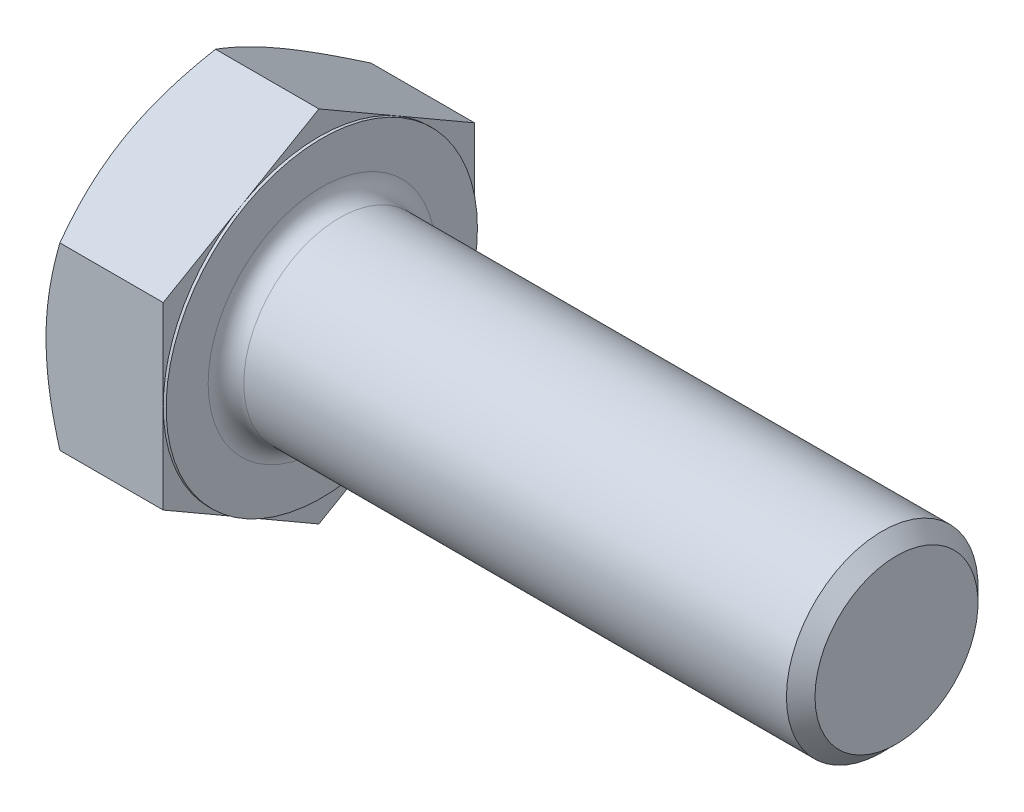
ISO-10303-21;
HEADER;
FILE_DESCRIPTION(('STEP AP214'),'2;1');
FILE_NAME('part.step','',(''),(''),'','','');
FILE_SCHEMA(('AUTOMOTIVE_DESIGN { 1 0 10303 214 1 1 1 1 }'));
ENDSEC;
DATA;
#1=APPLICATION_CONTEXT('core data for automotive mechanical design processes');
#2=APPLICATION_PROTOCOL_DEFINITION('international standard','automotive_design',2000,#1);
#3=PRODUCT_CONTEXT('',#1,'mechanical');
#4=PRODUCT('Part','Part','',(#3));
#5=PRODUCT_RELATED_PRODUCT_CATEGORY('part','',(#4));
#6=PRODUCT_DEFINITION_FORMATION('','',#4);
#7=PRODUCT_DEFINITION_CONTEXT('part definition',#1,'design');
#8=PRODUCT_DEFINITION('design','',#6,#7);
#9=PRODUCT_DEFINITION_SHAPE('','',#8);
#10=(LENGTH_UNIT() NAMED_UNIT(*) SI_UNIT(.MILLI.,.METRE.));
#11=(NAMED_UNIT(*) PLANE_ANGLE_UNIT() SI_UNIT($,.RADIAN.));
#12=(NAMED_UNIT(*) SI_UNIT($,.STERADIAN.) SOLID_ANGLE_UNIT());
#13=UNCERTAINTY_MEASURE_WITH_UNIT(LENGTH_MEASURE(1.E-05),#10,'distance_accuracy_value','');
#14=(GEOMETRIC_REPRESENTATION_CONTEXT(3) GLOBAL_UNCERTAINTY_ASSIGNED_CONTEXT((#13)) GLOBAL_UNIT_ASSIGNED_CONTEXT((#10,
#11,#12)) REPRESENTATION_CONTEXT('',''));
#15=CARTESIAN_POINT('',(0.,0.,0.));
#16=DIRECTION('',(0.,0.,1.));
#17=DIRECTION('',(1.,0.,0.));
#18=AXIS2_PLACEMENT_3D('',#15,#16,#17);
#19=CARTESIAN_POINT('',(15.9258,23.8301323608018,0.));
#20=DIRECTION('',(1.,0.,0.));
#21=DIRECTION('',(0.,0.,-1.));
#22=AXIS2_PLACEMENT_3D('',#19,#20,#21);
#23=PLANE('',#22);
#24=CARTESIAN_POINT('',(15.9258,0.,0.));
#25=DIRECTION('',(1.,0.,0.));
#26=DIRECTION('',(0.,0.,-1.));
#27=AXIS2_PLACEMENT_3D('',#24,#25,#26);
#28=CIRCLE('',#27,15.0622);
#29=CARTESIAN_POINT('',(15.9258,0.,-15.0622));
#30=VERTEX_POINT('',#29);
#31=EDGE_CURVE('E47',#30,#30,#28,.F.);
#32=ORIENTED_EDGE('',*,*,#31,.T.);
#33=EDGE_LOOP('',(#32));
#34=FACE_BOUND('',#33,.T.);
#35=CARTESIAN_POINT('',(15.9258,0.,0.));
#36=DIRECTION('',(1.,0.,0.));
#37=DIRECTION('',(0.,0.,-1.));
#38=AXIS2_PLACEMENT_3D('',#35,#36,#37);
#39=CIRCLE('',#38,20.6375);
#40=CARTESIAN_POINT('',(15.9258,0.,-20.6375));
#41=VERTEX_POINT('',#40);
#42=EDGE_CURVE('E305',#41,#41,#39,.T.);
#43=ORIENTED_EDGE('',*,*,#42,.T.);
#44=EDGE_LOOP('',(#43));
#45=FACE_BOUND('',#44,.T.);
#46=ADVANCED_FACE('F39',(#34,#45),#23,.T.);
#47=CARTESIAN_POINT('',(0.,0.,0.));
#48=DIRECTION('',(-1.,0.,0.));
#49=DIRECTION('',(0.,0.,1.));
#50=AXIS2_PLACEMENT_3D('',#47,#48,#49);
#51=CYLINDRICAL_SURFACE('',#50,12.7);
#52=CARTESIAN_POINT('',(18.288,0.,0.));
#53=DIRECTION('',(1.,0.,0.));
#54=DIRECTION('',(0.,0.,-1.));
#55=AXIS2_PLACEMENT_3D('',#52,#53,#54);
#56=CIRCLE('',#55,12.7);
#57=CARTESIAN_POINT('',(18.288,0.,-12.7));
#58=VERTEX_POINT('',#57);
#59=EDGE_CURVE('E11',#58,#58,#56,.T.);
#60=ORIENTED_EDGE('',*,*,#59,.T.);
#61=EDGE_LOOP('',(#60));
#62=FACE_BOUND('',#61,.T.);
#63=CARTESIAN_POINT('',(90.2335,0.,0.));
#64=DIRECTION('',(-1.,0.,0.));
#65=DIRECTION('',(0.,0.,1.));
#66=AXIS2_PLACEMENT_3D('',#63,#64,#65);
#67=CIRCLE('',#66,12.7);
#68=CARTESIAN_POINT('',(90.2335,0.,12.7));
#69=VERTEX_POINT('',#68);
#70=EDGE_CURVE('E284',#69,#69,#67,.T.);
#71=ORIENTED_EDGE('',*,*,#70,.T.);
#72=EDGE_LOOP('',(#71));
#73=FACE_BOUND('',#72,.T.);
#74=ADVANCED_FACE('F257',(#62,#73),#51,.T.);
#75=CARTESIAN_POINT('',(92.1258,0.,0.));
#76=DIRECTION('',(-1.,0.,0.));
#77=DIRECTION('',(0.,0.,1.));
#78=AXIS2_PLACEMENT_3D('',#75,#76,#77);
#79=CONICAL_SURFACE('',#78,10.8077,0.785398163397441);
#80=ORIENTED_EDGE('',*,*,#70,.F.);
#81=EDGE_LOOP('',(#80));
#82=FACE_BOUND('',#81,.T.);
#83=CARTESIAN_POINT('',(92.1258,0.,0.));
#84=DIRECTION('',(-1.,0.,0.));
#85=DIRECTION('',(0.,0.,1.));
#86=AXIS2_PLACEMENT_3D('',#83,#84,#85);
#87=CIRCLE('',#86,10.8077);
#88=CARTESIAN_POINT('',(92.1258,0.,10.8077));
#89=VERTEX_POINT('',#88);
#90=EDGE_CURVE('E282',#89,#89,#87,.T.);
#91=ORIENTED_EDGE('',*,*,#90,.T.);
#92=EDGE_LOOP('',(#91));
#93=FACE_BOUND('',#92,.T.);
#94=ADVANCED_FACE('F262',(#82,#93),#79,.T.);
#95=CARTESIAN_POINT('',(92.1258,0.,0.));
#96=DIRECTION('',(-1.,0.,0.));
#97=DIRECTION('',(0.,0.,1.));
#98=AXIS2_PLACEMENT_3D('',#95,#96,#97);
#99=PLANE('',#98);
#100=ORIENTED_EDGE('',*,*,#90,.F.);
#101=EDGE_LOOP('',(#100));
#102=FACE_BOUND('',#101,.T.);
#103=ADVANCED_FACE('F269',(#102),#99,.F.);
#104=CARTESIAN_POINT('',(15.5448,20.6375,0.));
#105=DIRECTION('',(1.,0.,0.));
#106=DIRECTION('',(0.,0.,-1.));
#107=AXIS2_PLACEMENT_3D('',#104,#105,#106);
#108=PLANE('',#107);
#109=DIRECTION('',(0.,0.500000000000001,0.866025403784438));
#110=VECTOR('',#109,1.);
#111=CARTESIAN_POINT('',(15.5448,11.9150661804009,-20.6375));
#112=LINE('',#111,#110);
#113=CARTESIAN_POINT('',(15.5448,11.9150661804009,-20.6375));
#114=VERTEX_POINT('',#113);
#115=CARTESIAN_POINT('',(15.5448,17.8725992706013,-10.31875));
#116=VERTEX_POINT('',#115);
#117=EDGE_CURVE('E171',#114,#116,#112,.T.);
#118=ORIENTED_EDGE('',*,*,#117,.T.);
#119=CARTESIAN_POINT('',(15.5448,0.,0.));
#120=DIRECTION('',(-1.,0.,0.));
#121=DIRECTION('',(0.,0.,1.));
#122=AXIS2_PLACEMENT_3D('',#119,#120,#121);
#123=CIRCLE('',#122,20.6375);
#124=CARTESIAN_POINT('',(15.5448,0.,-20.6375));
#125=VERTEX_POINT('',#124);
#126=EDGE_CURVE('E54',#116,#125,#123,.T.);
#127=ORIENTED_EDGE('',*,*,#126,.T.);
#128=DIRECTION('',(0.,1.,0.));
#129=VECTOR('',#128,1.);
#130=CARTESIAN_POINT('',(15.5448,11.9150661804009,-20.6375));
#131=LINE('',#130,#129);
#132=EDGE_CURVE('E308',#125,#114,#131,.T.);
#133=ORIENTED_EDGE('',*,*,#132,.T.);
#134=EDGE_LOOP('',(#118,#127,#133));
#135=FACE_BOUND('',#134,.T.);
#136=ADVANCED_FACE('F272',(#135),#108,.T.);
#137=CARTESIAN_POINT('',(15.5448,23.8301323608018,0.));
#138=VERTEX_POINT('',#137);
#139=EDGE_CURVE('E169',#116,#138,#112,.T.);
#140=ORIENTED_EDGE('',*,*,#139,.T.);
#141=DIRECTION('',(0.,-0.500000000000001,0.866025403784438));
#142=VECTOR('',#141,1.);
#143=CARTESIAN_POINT('',(15.5448,23.8301323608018,0.));
#144=LINE('',#143,#142);
#145=CARTESIAN_POINT('',(15.5448,17.8725992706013,10.31875));
#146=VERTEX_POINT('',#145);
#147=EDGE_CURVE('E168',#138,#146,#144,.T.);
#148=ORIENTED_EDGE('',*,*,#147,.T.);
#149=EDGE_CURVE('E157',#146,#116,#123,.T.);
#150=ORIENTED_EDGE('',*,*,#149,.T.);
#151=EDGE_LOOP('',(#140,#148,#150));
#152=FACE_BOUND('',#151,.T.);
#153=ADVANCED_FACE('F278',(#152),#108,.T.);
#154=CARTESIAN_POINT('',(15.5448,11.9150661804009,20.6375));
#155=VERTEX_POINT('',#154);
#156=EDGE_CURVE('E136',#146,#155,#144,.T.);
#157=ORIENTED_EDGE('',*,*,#156,.T.);
#158=DIRECTION('',(0.,-1.,0.));
#159=VECTOR('',#158,1.);
#160=CARTESIAN_POINT('',(15.5448,11.9150661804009,20.6375));
#161=LINE('',#160,#159);
#162=CARTESIAN_POINT('',(15.5448,0.,20.6375));
#163=VERTEX_POINT('',#162);
#164=EDGE_CURVE('E130',#155,#163,#161,.T.);
#165=ORIENTED_EDGE('',*,*,#164,.T.);
#166=EDGE_CURVE('E134',#163,#146,#123,.T.);
#167=ORIENTED_EDGE('',*,*,#166,.T.);
#168=EDGE_LOOP('',(#157,#165,#167));
#169=FACE_BOUND('',#168,.T.);
#170=ADVANCED_FACE('F132',(#169),#108,.T.);
#171=CARTESIAN_POINT('',(15.5448,-11.9150661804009,20.6375));
#172=VERTEX_POINT('',#171);
#173=EDGE_CURVE('E140',#163,#172,#161,.T.);
#174=ORIENTED_EDGE('',*,*,#173,.T.);
#175=DIRECTION('',(0.,-0.500000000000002,-0.866025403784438));
#176=VECTOR('',#175,1.);
#177=CARTESIAN_POINT('',(15.5448,-23.8301323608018,0.));
#178=LINE('',#177,#176);
#179=CARTESIAN_POINT('',(15.5448,-17.8725992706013,10.31875));
#180=VERTEX_POINT('',#179);
#181=EDGE_CURVE('E147',#172,#180,#178,.T.);
#182=ORIENTED_EDGE('',*,*,#181,.T.);
#183=EDGE_CURVE('E144',#180,#163,#123,.T.);
#184=ORIENTED_EDGE('',*,*,#183,.T.);
#185=EDGE_LOOP('',(#174,#182,#184));
#186=FACE_BOUND('',#185,.T.);
#187=ADVANCED_FACE('F145',(#186),#108,.T.);
#188=CARTESIAN_POINT('',(15.5448,-23.8301323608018,0.));
#189=VERTEX_POINT('',#188);
#190=EDGE_CURVE('E163',#180,#189,#178,.T.);
#191=ORIENTED_EDGE('',*,*,#190,.T.);
#192=DIRECTION('',(0.,0.5,-0.866025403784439));
#193=VECTOR('',#192,1.);
#194=CARTESIAN_POINT('',(15.5448,-11.9150661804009,-20.6375));
#195=LINE('',#194,#193);
#196=CARTESIAN_POINT('',(15.5448,-17.8725992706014,-10.31875));
#197=VERTEX_POINT('',#196);
#198=EDGE_CURVE('E346',#189,#197,#195,.T.);
#199=ORIENTED_EDGE('',*,*,#198,.T.);
#200=EDGE_CURVE('E151',#197,#180,#123,.T.);
#201=ORIENTED_EDGE('',*,*,#200,.T.);
#202=EDGE_LOOP('',(#191,#199,#201));
#203=FACE_BOUND('',#202,.T.);
#204=ADVANCED_FACE('F347',(#203),#108,.T.);
#205=CARTESIAN_POINT('',(15.5448,-11.9150661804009,-20.6375));
#206=VERTEX_POINT('',#205);
#207=EDGE_CURVE('E158',#197,#206,#195,.T.);
#208=ORIENTED_EDGE('',*,*,#207,.T.);
#209=EDGE_CURVE('E309',#206,#125,#131,.T.);
#210=ORIENTED_EDGE('',*,*,#209,.T.);
#211=EDGE_CURVE('E316',#125,#197,#123,.T.);
#212=ORIENTED_EDGE('',*,*,#211,.T.);
#213=EDGE_LOOP('',(#208,#210,#212));
#214=FACE_BOUND('',#213,.T.);
#215=ADVANCED_FACE('F279',(#214),#108,.T.);
#216=CARTESIAN_POINT('',(0.,0.,0.));
#217=DIRECTION('',(-1.,0.,0.));
#218=DIRECTION('',(0.,0.,1.));
#219=AXIS2_PLACEMENT_3D('',#216,#217,#218);
#220=CYLINDRICAL_SURFACE('',#219,20.6375);
#221=ORIENTED_EDGE('',*,*,#126,.F.);
#222=ORIENTED_EDGE('',*,*,#149,.F.);
#223=ORIENTED_EDGE('',*,*,#166,.F.);
#224=ORIENTED_EDGE('',*,*,#183,.F.);
#225=ORIENTED_EDGE('',*,*,#200,.F.);
#226=ORIENTED_EDGE('',*,*,#211,.F.);
#227=EDGE_LOOP('',(#221,#222,#223,#224,#225,#226));
#228=FACE_BOUND('',#227,.T.);
#229=ORIENTED_EDGE('',*,*,#42,.F.);
#230=EDGE_LOOP('',(#229));
#231=FACE_BOUND('',#230,.T.);
#232=ADVANCED_FACE('F154',(#228,#231),#220,.T.);
#233=CARTESIAN_POINT('',(0.,23.8301323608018,0.));
#234=DIRECTION('',(1.,0.,0.));
#235=DIRECTION('',(0.,0.,-1.));
#236=AXIS2_PLACEMENT_3D('',#233,#234,#235);
#237=PLANE('',#236);
#238=CARTESIAN_POINT('',(0.,0.,0.));
#239=DIRECTION('',(1.,0.,0.));
#240=DIRECTION('',(0.,0.,-1.));
#241=AXIS2_PLACEMENT_3D('',#238,#239,#240);
#242=CIRCLE('',#241,20.6375);
#243=CARTESIAN_POINT('',(0.,0.,-20.6375));
#244=VERTEX_POINT('',#243);
#245=CARTESIAN_POINT('',(0.,17.8725992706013,-10.31875));
#246=VERTEX_POINT('',#245);
#247=EDGE_CURVE('E304',#244,#246,#242,.T.);
#248=ORIENTED_EDGE('',*,*,#247,.F.);
#249=CARTESIAN_POINT('',(0.,-17.8725992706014,-10.31875));
#250=VERTEX_POINT('',#249);
#251=EDGE_CURVE('E300',#250,#244,#242,.T.);
#252=ORIENTED_EDGE('',*,*,#251,.F.);
#253=CARTESIAN_POINT('',(0.,-17.8725992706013,10.31875));
#254=VERTEX_POINT('',#253);
#255=EDGE_CURVE('E303',#254,#250,#242,.T.);
#256=ORIENTED_EDGE('',*,*,#255,.F.);
#257=CARTESIAN_POINT('',(0.,0.,20.6375));
#258=VERTEX_POINT('',#257);
#259=EDGE_CURVE('E339',#258,#254,#242,.T.);
#260=ORIENTED_EDGE('',*,*,#259,.F.);
#261=CARTESIAN_POINT('',(0.,0.,0.));
#262=DIRECTION('',(-1.,0.,0.));
#263=DIRECTION('',(0.,0.,1.));
#264=AXIS2_PLACEMENT_3D('',#261,#262,#263);
#265=CIRCLE('',#264,20.6375);
#266=CARTESIAN_POINT('',(0.,17.8725992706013,10.31875));
#267=VERTEX_POINT('',#266);
#268=EDGE_CURVE('E172',#258,#267,#265,.T.);
#269=ORIENTED_EDGE('',*,*,#268,.T.);
#270=EDGE_CURVE('E362',#246,#267,#242,.T.);
#271=ORIENTED_EDGE('',*,*,#270,.F.);
#272=EDGE_LOOP('',(#248,#252,#256,#260,#269,#271));
#273=FACE_BOUND('',#272,.T.);
#274=ADVANCED_FACE('F203',(#273),#237,.F.);
#275=CARTESIAN_POINT('',(0.,0.,0.));
#276=DIRECTION('',(1.,0.,0.));
#277=DIRECTION('',(0.,0.,-1.));
#278=AXIS2_PLACEMENT_3D('',#275,#276,#277);
#279=CONICAL_SURFACE('',#278,20.6375,1.0471975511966);
#280=CARTESIAN_POINT('',(1.84333382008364,11.914950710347,20.6377));
#281=CARTESIAN_POINT('',(1.69214337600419,12.1768388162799,20.1840964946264));
#282=CARTESIAN_POINT('',(1.54781374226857,12.4397484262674,19.7287236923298));
#283=CARTESIAN_POINT('',(1.27478315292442,12.9676758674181,18.814326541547));
#284=CARTESIAN_POINT('',(1.14608733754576,13.2326943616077,18.3553010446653));
#285=CARTESIAN_POINT('',(0.906054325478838,13.7653517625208,17.4327113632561));
#286=CARTESIAN_POINT('',(0.794758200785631,14.0329953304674,16.9691391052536));
#287=CARTESIAN_POINT('',(0.591914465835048,14.5701421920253,16.0387734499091));
#288=CARTESIAN_POINT('',(0.50036572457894,14.8396453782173,15.571980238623));
#289=CARTESIAN_POINT('',(0.340910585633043,15.3736059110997,14.6471334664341));
#290=CARTESIAN_POINT('',(0.272476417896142,15.6380236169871,14.1891485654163));
#291=CARTESIAN_POINT('',(0.157727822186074,16.1680706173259,13.27108023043));
#292=CARTESIAN_POINT('',(0.111413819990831,16.4336999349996,12.8109967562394));
#293=CARTESIAN_POINT('',(0.0420749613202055,16.9654047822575,11.890056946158));
#294=CARTESIAN_POINT('',(0.0190224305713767,17.2314794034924,11.4292021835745));
#295=CARTESIAN_POINT('',(-0.00329774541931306,17.7638741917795,10.5070673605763));
#296=CARTESIAN_POINT('',(-0.00256612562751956,18.03019435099,10.045787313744));
#297=CARTESIAN_POINT('',(0.0210208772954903,18.528085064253,9.18341530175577));
#298=CARTESIAN_POINT('',(0.0410000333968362,18.759691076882,8.78226192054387));
#299=CARTESIAN_POINT('',(0.0985671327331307,19.2223501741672,7.98091285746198));
#300=CARTESIAN_POINT('',(0.136154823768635,19.4534032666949,7.58071716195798));
#301=CARTESIAN_POINT('',(0.228287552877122,19.9148711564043,6.78143133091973));
#302=CARTESIAN_POINT('',(0.282847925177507,20.1452851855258,6.38234252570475));
#303=CARTESIAN_POINT('',(0.407960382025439,20.605009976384,5.58607583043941));
#304=CARTESIAN_POINT('',(0.478512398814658,20.8343207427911,5.18889793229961));
#305=CARTESIAN_POINT('',(0.71596653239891,21.530459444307,3.98315033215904));
#306=CARTESIAN_POINT('',(0.906558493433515,21.9953095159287,3.17800639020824));
#307=CARTESIAN_POINT('',(1.23103244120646,22.6874510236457,1.97918213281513));
#308=CARTESIAN_POINT('',(1.34550466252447,22.9171109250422,1.58139951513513));
#309=CARTESIAN_POINT('',(1.58603801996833,23.3748421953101,0.788585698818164));
#310=CARTESIAN_POINT('',(1.71209588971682,23.6029139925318,0.393553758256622));
#311=CARTESIAN_POINT('',(1.84333382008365,23.8302478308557,-0.000200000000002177));
#312=B_SPLINE_CURVE_WITH_KNOTS('',3,(#280,#281,#282,#283,#284,#285,#286,#287,#288,#289,#290,
#291,#292,#293,#294,#295,#296,#297,#298,#299,#300,#301,#302,#303,#304,#305,#306,#307,#308,#309,
#310,#311),.UNSPECIFIED.,.F.,.F.,(4,2,2,2,2,2,2,2,2,2,2,2,2,2,2,4),(0.,1.63552456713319,
3.27158542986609,4.91145173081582,6.55122408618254,8.1505234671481,9.74985363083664,
11.3472788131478,12.9446546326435,14.3352468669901,15.7258191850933,17.1176515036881,
18.5094779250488,21.3544387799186,22.7744411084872,24.1940443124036),.UNSPECIFIED.);
#313=CARTESIAN_POINT('',(1.84326715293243,23.8301323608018,0.));
#314=VERTEX_POINT('',#313);
#315=EDGE_CURVE('E223',#267,#314,#312,.T.);
#316=ORIENTED_EDGE('',*,*,#315,.T.);
#317=CARTESIAN_POINT('',(1.84333382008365,23.8302478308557,0.0002));
#318=CARTESIAN_POINT('',(1.69214337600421,23.5683597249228,-0.453403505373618));
#319=CARTESIAN_POINT('',(1.54781374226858,23.3054501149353,-0.908776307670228));
#320=CARTESIAN_POINT('',(1.27478315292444,22.7775226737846,-1.82317345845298));
#321=CARTESIAN_POINT('',(1.14608733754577,22.512504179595,-2.28219895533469));
#322=CARTESIAN_POINT('',(0.906054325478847,21.9798467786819,-3.20478863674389));
#323=CARTESIAN_POINT('',(0.79475820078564,21.7122032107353,-3.66836089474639));
#324=CARTESIAN_POINT('',(0.591914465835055,21.1750563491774,-4.59872655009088));
#325=CARTESIAN_POINT('',(0.500365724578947,20.9055531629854,-5.06551976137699));
#326=CARTESIAN_POINT('',(0.340910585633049,20.371592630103,-5.99036653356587));
#327=CARTESIAN_POINT('',(0.272476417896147,20.1071749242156,-6.44835143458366));
#328=CARTESIAN_POINT('',(0.157727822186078,19.5771279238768,-7.36641976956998));
#329=CARTESIAN_POINT('',(0.111413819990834,19.3114986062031,-7.82650324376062));
#330=CARTESIAN_POINT('',(0.0420749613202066,18.7797937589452,-8.74744305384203));
#331=CARTESIAN_POINT('',(0.019022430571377,18.5137191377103,-9.2082978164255));
#332=CARTESIAN_POINT('',(-0.00329774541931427,17.9813243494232,-10.1304326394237));
#333=CARTESIAN_POINT('',(-0.00256612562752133,17.7150041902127,-10.591712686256));
#334=CARTESIAN_POINT('',(0.0210208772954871,17.2171134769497,-11.4540846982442));
#335=CARTESIAN_POINT('',(0.0410000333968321,16.9855074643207,-11.8552380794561));
#336=CARTESIAN_POINT('',(0.0985671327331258,16.5228483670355,-12.656587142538));
#337=CARTESIAN_POINT('',(0.136154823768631,16.2917952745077,-13.056782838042));
#338=CARTESIAN_POINT('',(0.228287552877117,15.8303273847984,-13.8560686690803));
#339=CARTESIAN_POINT('',(0.282847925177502,15.5999133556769,-14.2551574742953));
#340=CARTESIAN_POINT('',(0.407960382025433,15.1401885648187,-15.0514241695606));
#341=CARTESIAN_POINT('',(0.478512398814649,14.9108777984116,-15.4486020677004));
#342=CARTESIAN_POINT('',(0.715966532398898,14.2147390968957,-16.654349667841));
#343=CARTESIAN_POINT('',(0.906558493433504,13.749889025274,-17.4594936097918));
#344=CARTESIAN_POINT('',(1.23103244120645,13.057747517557,-18.6583178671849));
#345=CARTESIAN_POINT('',(1.34550466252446,12.8280876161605,-19.0561004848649));
#346=CARTESIAN_POINT('',(1.58603801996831,12.3703563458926,-19.8489143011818));
#347=CARTESIAN_POINT('',(1.7120958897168,12.1422845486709,-20.2439462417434));
#348=CARTESIAN_POINT('',(1.84333382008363,11.914950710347,-20.6377));
#349=B_SPLINE_CURVE_WITH_KNOTS('',3,(#317,#318,#319,#320,#321,#322,#323,#324,#325,#326,#327,
#328,#329,#330,#331,#332,#333,#334,#335,#336,#337,#338,#339,#340,#341,#342,#343,#344,#345,#346,
#347,#348),.UNSPECIFIED.,.F.,.F.,(4,2,2,2,2,2,2,2,2,2,2,2,2,2,2,4),(0.,1.63552456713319,
3.27158542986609,4.91145173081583,6.55122408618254,8.1505234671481,9.74985363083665,
11.3472788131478,12.9446546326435,14.3352468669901,15.7258191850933,17.1176515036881,
18.5094779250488,21.3544387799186,22.7744411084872,24.1940443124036),.UNSPECIFIED.);
#350=EDGE_CURVE('E62',#314,#246,#349,.T.);
#351=ORIENTED_EDGE('',*,*,#350,.T.);
#352=ORIENTED_EDGE('',*,*,#270,.T.);
#353=EDGE_LOOP('',(#316,#351,#352));
#354=FACE_BOUND('',#353,.T.);
#355=ADVANCED_FACE('F363',(#354),#279,.T.);
#356=CARTESIAN_POINT('',(10.1233678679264,-32.1118563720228,20.6375));
#357=CARTESIAN_POINT('',(9.90427008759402,-31.6607456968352,20.6375));
#358=CARTESIAN_POINT('',(9.68625680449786,-31.2091085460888,20.6375));
#359=CARTESIAN_POINT('',(9.25264463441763,-30.3046714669,20.6375));
#360=CARTESIAN_POINT('',(9.03704577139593,-29.851871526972,20.6375));
#361=CARTESIAN_POINT('',(8.39418278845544,-28.4914436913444,20.6375));
#362=CARTESIAN_POINT('',(7.97091645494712,-27.5819195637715,20.6375));
#363=CARTESIAN_POINT('',(7.13532758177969,-25.7519215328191,20.6375));
#364=CARTESIAN_POINT('',(6.72307624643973,-24.8314150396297,20.6375));
#365=CARTESIAN_POINT('',(5.91529515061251,-22.9831190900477,20.6375));
#366=CARTESIAN_POINT('',(5.51976460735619,-22.0553299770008,20.6375));
#367=CARTESIAN_POINT('',(4.73729219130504,-20.1605940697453,20.6375));
#368=CARTESIAN_POINT('',(4.35105046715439,-19.1933566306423,20.6375));
#369=CARTESIAN_POINT('',(3.60754060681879,-17.2475981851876,20.6375));
#370=CARTESIAN_POINT('',(3.25027570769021,-16.2690759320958,20.6375));
#371=CARTESIAN_POINT('',(2.57402614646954,-14.3010202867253,20.6375));
#372=CARTESIAN_POINT('',(2.25496489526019,-13.3115134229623,20.6375));
#373=CARTESIAN_POINT('',(1.66527212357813,-11.3182120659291,20.6375));
#374=CARTESIAN_POINT('',(1.39462546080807,-10.3144221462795,20.6375));
#375=CARTESIAN_POINT('',(1.03545163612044,-8.80063418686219,20.6375));
#376=CARTESIAN_POINT('',(0.923771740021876,-8.29609693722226,20.6375));
#377=CARTESIAN_POINT('',(0.71732925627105,-7.28355521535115,20.6375));
#378=CARTESIAN_POINT('',(0.622566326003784,-6.7755508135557,20.6375));
#379=CARTESIAN_POINT('',(0.451625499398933,-5.75642686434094,20.6375));
#380=CARTESIAN_POINT('',(0.375446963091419,-5.24530742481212,20.6375));
#381=CARTESIAN_POINT('',(0.243185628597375,-4.22045710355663,20.6375));
#382=CARTESIAN_POINT('',(0.187102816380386,-3.70672622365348,20.6375));
#383=CARTESIAN_POINT('',(0.0968611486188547,-2.68415366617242,20.6375));
#384=CARTESIAN_POINT('',(0.0624231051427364,-2.17533677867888,20.6375));
#385=CARTESIAN_POINT('',(0.0151010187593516,-1.15670325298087,20.6375));
#386=CARTESIAN_POINT('',(0.0022166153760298,-0.646886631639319,20.6375));
#387=CARTESIAN_POINT('',(-0.00169134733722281,0.372835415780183,20.6375));
#388=CARTESIAN_POINT('',(0.00728516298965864,0.882740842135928,20.6375));
#389=CARTESIAN_POINT('',(0.0468787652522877,1.9017164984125,20.6375));
#390=CARTESIAN_POINT('',(0.0774968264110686,2.41078668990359,20.6375));
#391=CARTESIAN_POINT('',(0.17617491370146,3.63103902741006,20.6375));
#392=CARTESIAN_POINT('',(0.254325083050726,4.34141978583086,20.6375));
#393=CARTESIAN_POINT('',(0.448536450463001,5.75698322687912,20.6375));
#394=CARTESIAN_POINT('',(0.564602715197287,6.46216520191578,20.6375));
#395=CARTESIAN_POINT('',(0.83051756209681,7.86663403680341,20.6375));
#396=CARTESIAN_POINT('',(0.980392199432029,8.56591591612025,20.6375));
#397=CARTESIAN_POINT('',(1.30934404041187,9.95750121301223,20.6375));
#398=CARTESIAN_POINT('',(1.48842082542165,10.6498047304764,20.6375));
#399=CARTESIAN_POINT('',(1.8756560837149,12.0426964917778,20.6375));
#400=CARTESIAN_POINT('',(2.08437031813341,12.7431291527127,20.6375));
#401=CARTESIAN_POINT('',(2.52357115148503,14.1370960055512,20.6375));
#402=CARTESIAN_POINT('',(2.75405789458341,14.8306301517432,20.6375));
#403=CARTESIAN_POINT('',(3.23312600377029,16.2111388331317,20.6375));
#404=CARTESIAN_POINT('',(3.48170148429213,16.8981154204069,20.6375));
#405=CARTESIAN_POINT('',(3.99400235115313,18.2663626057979,20.6375));
#406=CARTESIAN_POINT('',(4.25772755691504,18.9476332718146,20.6375));
#407=CARTESIAN_POINT('',(4.8988376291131,20.5590145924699,20.6375));
#408=CARTESIAN_POINT('',(5.28183896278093,21.4868873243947,20.6375));
#409=CARTESIAN_POINT('',(6.06661514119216,23.3346835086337,20.6375));
#410=CARTESIAN_POINT('',(6.46839117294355,24.2546064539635,20.6375));
#411=CARTESIAN_POINT('',(7.28694571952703,26.0879885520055,20.6375));
#412=CARTESIAN_POINT('',(7.70372765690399,27.001446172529,20.6375));
#413=CARTESIAN_POINT('',(8.54925608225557,28.8227686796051,20.6375));
#414=CARTESIAN_POINT('',(8.97800230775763,29.7306336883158,20.6375));
#415=CARTESIAN_POINT('',(9.84569867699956,31.5427118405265,20.6375));
#416=CARTESIAN_POINT('',(10.2846596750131,32.4469197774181,20.6375));
#417=CARTESIAN_POINT('',(11.1705735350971,34.2514113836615,20.6375));
#418=CARTESIAN_POINT('',(11.6175264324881,35.1516950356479,20.6375));
#419=CARTESIAN_POINT('',(12.517991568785,36.9488265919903,20.6375));
#420=CARTESIAN_POINT('',(12.9715029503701,37.845674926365,20.6375));
#421=CARTESIAN_POINT('',(13.8840629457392,39.6365449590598,20.6375));
#422=CARTESIAN_POINT('',(14.3431115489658,40.5305666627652,20.6375));
#423=CARTESIAN_POINT('',(15.6493121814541,43.0582372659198,20.6375));
#424=CARTESIAN_POINT('',(16.5019361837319,44.6890583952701,20.6375));
#425=CARTESIAN_POINT('',(18.218831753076,47.944618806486,20.6375));
#426=CARTESIAN_POINT('',(19.0831037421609,49.5693578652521,20.6375));
#427=CARTESIAN_POINT('',(20.8183569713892,52.8099478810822,20.6375));
#428=CARTESIAN_POINT('',(21.6893156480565,54.4258109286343,20.6375));
#429=CARTESIAN_POINT('',(23.000931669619,56.8467384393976,20.6375));
#430=CARTESIAN_POINT('',(23.4389878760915,57.6532142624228,20.6375));
#431=CARTESIAN_POINT('',(24.3166534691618,59.2653187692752,20.6375));
#432=CARTESIAN_POINT('',(24.756262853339,60.0709474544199,20.6375));
#433=CARTESIAN_POINT('',(25.1965591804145,60.8762006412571,20.6375));
#434=B_SPLINE_CURVE_WITH_KNOTS('',3,(#356,#357,#358,#359,#360,#361,#362,#363,#364,#365,#366,
#367,#368,#369,#370,#371,#372,#373,#374,#375,#376,#377,#378,#379,#380,#381,#382,#383,#384,#385,
#386,#387,#388,#389,#390,#391,#392,#393,#394,#395,#396,#397,#398,#399,#400,#401,#402,#403,#404,
#405,#406,#407,#408,#409,#410,#411,#412,#413,#414,#415,#416,#417,#418,#419,#420,#421,#422,#423,
#424,#425,#426,#427,#428,#429,#430,#431,#432,#433),.UNSPECIFIED.,.F.,.F.,(4,2,2,2,2,2,2,2,2,2,2,
2,2,2,2,2,2,2,2,2,2,2,2,2,2,2,2,2,2,2,2,2,2,2,2,2,2,2,4),(0.,1.5045045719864,3.00902406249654,
6.01850276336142,9.04418712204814,12.0697296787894,15.1938876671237,18.3183941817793,
21.4365280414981,24.5536849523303,26.1036962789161,27.6536762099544,29.2036027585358,
30.7535282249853,32.2830277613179,33.8125017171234,35.341980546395,36.8715278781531,
39.0143441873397,41.1574469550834,43.302207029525,45.4469363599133,47.6391167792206,
49.8313117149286,52.0227965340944,54.2142552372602,57.2254091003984,60.2367535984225,
63.2487893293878,66.260759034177,69.2760903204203,72.2914349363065,75.3063888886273,
78.3213370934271,83.842036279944,89.362936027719,94.869839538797,97.6231396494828,
100.376435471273),.UNSPECIFIED.);
#435=CARTESIAN_POINT('',(1.84326715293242,11.9150661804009,20.6375));
#436=VERTEX_POINT('',#435);
#437=EDGE_CURVE('E237',#258,#436,#434,.T.);
#438=ORIENTED_EDGE('',*,*,#437,.T.);
#439=EDGE_CURVE('E236',#436,#267,#312,.T.);
#440=ORIENTED_EDGE('',*,*,#439,.T.);
#441=ORIENTED_EDGE('',*,*,#268,.F.);
#442=EDGE_LOOP('',(#438,#440,#441));
#443=FACE_BOUND('',#442,.T.);
#444=ADVANCED_FACE('F333',(#443),#279,.T.);
#445=CARTESIAN_POINT('',(1.84326715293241,-11.9150661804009,20.6375));
#446=VERTEX_POINT('',#445);
#447=EDGE_CURVE('E285',#446,#258,#434,.T.);
#448=ORIENTED_EDGE('',*,*,#447,.T.);
#449=ORIENTED_EDGE('',*,*,#259,.T.);
#450=CARTESIAN_POINT('',(1.84333382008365,-23.8302478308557,-0.000200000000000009));
#451=CARTESIAN_POINT('',(1.69214337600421,-23.5683597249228,0.453403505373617));
#452=CARTESIAN_POINT('',(1.54781374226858,-23.3054501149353,0.908776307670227));
#453=CARTESIAN_POINT('',(1.27478315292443,-22.7775226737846,1.82317345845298));
#454=CARTESIAN_POINT('',(1.14608733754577,-22.512504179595,2.28219895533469));
#455=CARTESIAN_POINT('',(0.906054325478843,-21.9798467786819,3.20478863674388));
#456=CARTESIAN_POINT('',(0.794758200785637,-21.7122032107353,3.66836089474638));
#457=CARTESIAN_POINT('',(0.591914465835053,-21.1750563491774,4.59872655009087));
#458=CARTESIAN_POINT('',(0.500365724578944,-20.9055531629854,5.06551976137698));
#459=CARTESIAN_POINT('',(0.340910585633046,-20.371592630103,5.99036653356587));
#460=CARTESIAN_POINT('',(0.272476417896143,-20.1071749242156,6.44835143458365));
#461=CARTESIAN_POINT('',(0.157727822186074,-19.5771279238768,7.36641976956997));
#462=CARTESIAN_POINT('',(0.11141381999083,-19.3114986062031,7.82650324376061));
#463=CARTESIAN_POINT('',(0.0420749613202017,-18.7797937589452,8.74744305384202));
#464=CARTESIAN_POINT('',(0.0190224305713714,-18.5137191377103,9.20829781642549));
#465=CARTESIAN_POINT('',(-0.00329774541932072,-17.9813243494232,10.1304326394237));
#466=CARTESIAN_POINT('',(-0.00256612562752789,-17.7150041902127,10.591712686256));
#467=CARTESIAN_POINT('',(0.0210208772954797,-17.2171134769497,11.4540846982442));
#468=CARTESIAN_POINT('',(0.0410000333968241,-16.9855074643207,11.8552380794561));
#469=CARTESIAN_POINT('',(0.0985671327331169,-16.5228483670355,12.656587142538));
#470=CARTESIAN_POINT('',(0.136154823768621,-16.2917952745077,13.056782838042));
#471=CARTESIAN_POINT('',(0.228287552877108,-15.8303273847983,13.8560686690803));
#472=CARTESIAN_POINT('',(0.282847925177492,-15.5999133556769,14.2551574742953));
#473=CARTESIAN_POINT('',(0.407960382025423,-15.1401885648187,15.0514241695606));
#474=CARTESIAN_POINT('',(0.47851239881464,-14.9108777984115,15.4486020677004));
#475=CARTESIAN_POINT('',(0.715966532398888,-14.2147390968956,16.654349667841));
#476=CARTESIAN_POINT('',(0.906558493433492,-13.7498890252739,17.4594936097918));
#477=CARTESIAN_POINT('',(1.23103244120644,-13.057747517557,18.6583178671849));
#478=CARTESIAN_POINT('',(1.34550466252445,-12.8280876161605,19.0561004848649));
#479=CARTESIAN_POINT('',(1.58603801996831,-12.3703563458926,19.8489143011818));
#480=CARTESIAN_POINT('',(1.7120958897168,-12.1422845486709,20.2439462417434));
#481=CARTESIAN_POINT('',(1.84333382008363,-11.914950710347,20.6377));
#482=B_SPLINE_CURVE_WITH_KNOTS('',3,(#450,#451,#452,#453,#454,#455,#456,#457,#458,#459,#460,
#461,#462,#463,#464,#465,#466,#467,#468,#469,#470,#471,#472,#473,#474,#475,#476,#477,#478,#479,
#480,#481),.UNSPECIFIED.,.F.,.F.,(4,2,2,2,2,2,2,2,2,2,2,2,2,2,2,4),(0.,1.63552456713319,
3.27158542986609,4.91145173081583,6.55122408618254,8.1505234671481,9.74985363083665,
11.3472788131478,12.9446546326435,14.3352468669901,15.7258191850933,17.1176515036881,
18.5094779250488,21.3544387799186,22.7744411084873,24.1940443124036),.UNSPECIFIED.);
#483=EDGE_CURVE('E225',#254,#446,#482,.T.);
#484=ORIENTED_EDGE('',*,*,#483,.T.);
#485=EDGE_LOOP('',(#448,#449,#484));
#486=FACE_BOUND('',#485,.T.);
#487=ADVANCED_FACE('F192',(#486),#279,.T.);
#488=CARTESIAN_POINT('',(1.84326715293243,-23.8301323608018,0.));
#489=VERTEX_POINT('',#488);
#490=EDGE_CURVE('E217',#489,#254,#482,.T.);
#491=ORIENTED_EDGE('',*,*,#490,.T.);
#492=ORIENTED_EDGE('',*,*,#255,.T.);
#493=CARTESIAN_POINT('',(1.84333382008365,-11.9149507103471,-20.6377));
#494=CARTESIAN_POINT('',(1.69214337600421,-12.1768388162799,-20.1840964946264));
#495=CARTESIAN_POINT('',(1.54781374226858,-12.4397484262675,-19.7287236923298));
#496=CARTESIAN_POINT('',(1.27478315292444,-12.9676758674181,-18.814326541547));
#497=CARTESIAN_POINT('',(1.14608733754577,-13.2326943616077,-18.3553010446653));
#498=CARTESIAN_POINT('',(0.906054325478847,-13.7653517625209,-17.4327113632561));
#499=CARTESIAN_POINT('',(0.794758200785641,-14.0329953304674,-16.9691391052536));
#500=CARTESIAN_POINT('',(0.591914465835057,-14.5701421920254,-16.0387734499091));
#501=CARTESIAN_POINT('',(0.500365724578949,-14.8396453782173,-15.571980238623));
#502=CARTESIAN_POINT('',(0.340910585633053,-15.3736059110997,-14.6471334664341));
#503=CARTESIAN_POINT('',(0.272476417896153,-15.6380236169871,-14.1891485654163));
#504=CARTESIAN_POINT('',(0.157727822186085,-16.1680706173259,-13.27108023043));
#505=CARTESIAN_POINT('',(0.111413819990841,-16.4336999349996,-12.8109967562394));
#506=CARTESIAN_POINT('',(0.0420749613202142,-16.9654047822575,-11.890056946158));
#507=CARTESIAN_POINT('',(0.0190224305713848,-17.2314794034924,-11.4292021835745));
#508=CARTESIAN_POINT('',(-0.00329774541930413,-17.7638741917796,-10.5070673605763));
#509=CARTESIAN_POINT('',(-0.00256612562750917,-18.03019435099,-10.045787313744));
#510=CARTESIAN_POINT('',(0.0210208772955,-18.528085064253,-9.18341530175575));
#511=CARTESIAN_POINT('',(0.0410000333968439,-18.759691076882,-8.78226192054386));
#512=CARTESIAN_POINT('',(0.0985671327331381,-19.2223501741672,-7.98091285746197));
#513=CARTESIAN_POINT('',(0.136154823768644,-19.453403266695,-7.58071716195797));
#514=CARTESIAN_POINT('',(0.228287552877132,-19.9148711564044,-6.78143133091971));
#515=CARTESIAN_POINT('',(0.282847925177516,-20.1452851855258,-6.38234252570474));
#516=CARTESIAN_POINT('',(0.407960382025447,-20.605009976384,-5.5860758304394));
#517=CARTESIAN_POINT('',(0.478512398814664,-20.8343207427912,-5.1888979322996));
#518=CARTESIAN_POINT('',(0.715966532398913,-21.5304594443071,-3.98315033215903));
#519=CARTESIAN_POINT('',(0.906558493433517,-21.9953095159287,-3.17800639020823));
#520=CARTESIAN_POINT('',(1.23103244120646,-22.6874510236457,-1.97918213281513));
#521=CARTESIAN_POINT('',(1.34550466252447,-22.9171109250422,-1.58139951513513));
#522=CARTESIAN_POINT('',(1.58603801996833,-23.3748421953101,-0.788585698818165));
#523=CARTESIAN_POINT('',(1.71209588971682,-23.6029139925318,-0.393553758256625));
#524=CARTESIAN_POINT('',(1.84333382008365,-23.8302478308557,0.00019999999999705));
#525=B_SPLINE_CURVE_WITH_KNOTS('',3,(#493,#494,#495,#496,#497,#498,#499,#500,#501,#502,#503,
#504,#505,#506,#507,#508,#509,#510,#511,#512,#513,#514,#515,#516,#517,#518,#519,#520,#521,#522,
#523,#524),.UNSPECIFIED.,.F.,.F.,(4,2,2,2,2,2,2,2,2,2,2,2,2,2,2,4),(0.,1.63552456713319,
3.27158542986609,4.91145173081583,6.55122408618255,8.15052346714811,9.74985363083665,
11.3472788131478,12.9446546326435,14.3352468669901,15.7258191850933,17.1176515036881,
18.5094779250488,21.3544387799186,22.7744411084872,24.1940443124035),.UNSPECIFIED.);
#526=EDGE_CURVE('E224',#250,#489,#525,.T.);
#527=ORIENTED_EDGE('',*,*,#526,.T.);
#528=EDGE_LOOP('',(#491,#492,#527));
#529=FACE_BOUND('',#528,.T.);
#530=ADVANCED_FACE('F361',(#529),#279,.T.);
#531=CARTESIAN_POINT('',(1.84326715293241,11.9150661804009,-20.6375));
#532=VERTEX_POINT('',#531);
#533=EDGE_CURVE('E226',#246,#532,#349,.T.);
#534=ORIENTED_EDGE('',*,*,#533,.T.);
#535=CARTESIAN_POINT('',(10.1233678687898,-32.1118563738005,-20.6375));
#536=CARTESIAN_POINT('',(9.90427008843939,-31.660745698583,-20.6375));
#537=CARTESIAN_POINT('',(9.68625680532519,-31.2091085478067,-20.6375));
#538=CARTESIAN_POINT('',(9.25264463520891,-30.3046714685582,-20.6375));
#539=CARTESIAN_POINT('',(9.03704577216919,-29.8518715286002,-20.6375));
#540=CARTESIAN_POINT('',(8.39418278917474,-28.4914436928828,-20.6375));
#541=CARTESIAN_POINT('',(7.97091645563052,-27.58191956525,-20.6375));
#542=CARTESIAN_POINT('',(7.13532758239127,-25.7519215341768,-20.6375));
#543=CARTESIAN_POINT('',(6.72307624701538,-24.8314150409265,-20.6375));
#544=CARTESIAN_POINT('',(5.91529515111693,-22.9831190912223,-20.6375));
#545=CARTESIAN_POINT('',(5.51976460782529,-22.0553299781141,-20.6375));
#546=CARTESIAN_POINT('',(4.73729219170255,-20.1605940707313,-20.6375));
#547=CARTESIAN_POINT('',(4.35105046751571,-19.1933566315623,-20.6375));
#548=CARTESIAN_POINT('',(3.60754060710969,-17.2475981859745,-20.6375));
#549=CARTESIAN_POINT('',(3.25027570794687,-16.2690759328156,-20.6375));
#550=CARTESIAN_POINT('',(2.57402614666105,-14.3010202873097,-20.6375));
#551=CARTESIAN_POINT('',(2.25496489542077,-13.3115134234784,-20.6375));
#552=CARTESIAN_POINT('',(1.66527212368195,-11.3182120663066,-20.6375));
#553=CARTESIAN_POINT('',(1.39462546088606,-10.3144221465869,-20.6375));
#554=CARTESIAN_POINT('',(1.03545163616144,-8.80063418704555,-20.6375));
#555=CARTESIAN_POINT('',(0.92377174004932,-8.29609693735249,-20.6375));
#556=CARTESIAN_POINT('',(0.717329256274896,-7.28355521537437,-20.6375));
#557=CARTESIAN_POINT('',(0.622566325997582,-6.77555081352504,-20.6375));
#558=CARTESIAN_POINT('',(0.451625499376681,-5.75642686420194,-20.6375));
#559=CARTESIAN_POINT('',(0.37544696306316,-5.24530742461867,-20.6375));
#560=CARTESIAN_POINT('',(0.24318562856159,-4.22045710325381,-20.6375));
#561=CARTESIAN_POINT('',(0.187102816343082,-3.70672622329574,-20.6375));
#562=CARTESIAN_POINT('',(0.0968611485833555,-2.684153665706,-20.6375));
#563=CARTESIAN_POINT('',(0.0624231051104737,-2.1753367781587,-20.6375));
#564=CARTESIAN_POINT('',(0.015101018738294,-1.15670325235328,-20.6375));
#565=CARTESIAN_POINT('',(0.00221661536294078,-0.646886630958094,-20.6375));
#566=CARTESIAN_POINT('',(-0.00169134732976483,0.372835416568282,-20.6375));
#567=CARTESIAN_POINT('',(0.00728516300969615,0.882740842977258,-20.6375));
#568=CARTESIAN_POINT('',(0.0468787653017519,1.90171649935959,-20.6375));
#569=CARTESIAN_POINT('',(0.0774968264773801,2.4107866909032,-20.6375));
#570=CARTESIAN_POINT('',(0.176174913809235,3.6310390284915,-20.6375));
#571=CARTESIAN_POINT('',(0.254325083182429,4.34141978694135,-20.6375));
#572=CARTESIAN_POINT('',(0.448536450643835,5.75698322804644,-20.6375));
#573=CARTESIAN_POINT('',(0.564602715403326,6.46216520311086,-20.6375));
#574=CARTESIAN_POINT('',(0.830517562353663,7.86663403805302,-20.6375));
#575=CARTESIAN_POINT('',(0.980392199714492,8.56591591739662,-20.6375));
#576=CARTESIAN_POINT('',(1.30934404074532,9.95750121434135,-20.6375));
#577=CARTESIAN_POINT('',(1.48842082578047,10.6498047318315,-20.6375));
#578=CARTESIAN_POINT('',(1.87565608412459,12.0426964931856,-20.6375));
#579=CARTESIAN_POINT('',(2.08437031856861,12.7431291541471,-20.6375));
#580=CARTESIAN_POINT('',(2.52357115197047,14.1370960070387,-20.6375));
#581=CARTESIAN_POINT('',(2.75405789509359,14.8306301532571,-20.6375));
#582=CARTESIAN_POINT('',(3.23312600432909,16.2111388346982,-20.6375));
#583=CARTESIAN_POINT('',(3.4817014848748,16.8981154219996,-20.6375));
#584=CARTESIAN_POINT('',(3.99400235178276,18.266362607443,-20.6375));
#585=CARTESIAN_POINT('',(4.25772755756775,18.9476332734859,-20.6375));
#586=CARTESIAN_POINT('',(4.89883762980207,20.5590145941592,-20.6375));
#587=CARTESIAN_POINT('',(5.28183896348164,21.4868873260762,-20.6375));
#588=CARTESIAN_POINT('',(6.06661514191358,23.3346835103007,-20.6375));
#589=CARTESIAN_POINT('',(6.46839117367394,24.2546064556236,-20.6375));
#590=CARTESIAN_POINT('',(7.28694572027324,26.0879885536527,-20.6375));
#591=CARTESIAN_POINT('',(7.70372765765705,27.00144617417,-20.6375));
#592=CARTESIAN_POINT('',(8.54925608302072,28.8227686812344,-20.6375));
#593=CARTESIAN_POINT('',(8.97800230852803,29.7306336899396,-20.6375));
#594=CARTESIAN_POINT('',(9.84569867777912,31.5427118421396,-20.6375));
#595=CARTESIAN_POINT('',(10.2846596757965,32.4469197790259,-20.6375));
#596=CARTESIAN_POINT('',(11.1705735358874,34.2514113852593,-20.6375));
#597=CARTESIAN_POINT('',(11.6175264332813,35.1516950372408,-20.6375));
#598=CARTESIAN_POINT('',(12.5179915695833,36.948826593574,-20.6375));
#599=CARTESIAN_POINT('',(12.9715029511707,37.8456749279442,-20.6375));
#600=CARTESIAN_POINT('',(13.8840629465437,39.6365449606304,-20.6375));
#601=CARTESIAN_POINT('',(14.3431115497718,40.5305666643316,-20.6375));
#602=CARTESIAN_POINT('',(15.649312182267,43.0582372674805,-20.6375));
#603=CARTESIAN_POINT('',(16.5019361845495,44.6890583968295,-20.6375));
#604=CARTESIAN_POINT('',(18.2188317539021,47.9446188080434,-20.6375));
#605=CARTESIAN_POINT('',(19.0831037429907,49.5693578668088,-20.6375));
#606=CARTESIAN_POINT('',(20.8183569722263,52.8099478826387,-20.6375));
#607=CARTESIAN_POINT('',(21.6893156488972,54.4258109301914,-20.6375));
#608=CARTESIAN_POINT('',(23.0009316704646,56.8467384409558,-20.6375));
#609=CARTESIAN_POINT('',(23.4389878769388,57.6532142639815,-20.6375));
#610=CARTESIAN_POINT('',(24.3166534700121,59.2653187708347,-20.6375));
#611=CARTESIAN_POINT('',(24.7562628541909,60.0709474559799,-20.6375));
#612=CARTESIAN_POINT('',(25.1965591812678,60.8762006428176,-20.6375));
#613=B_SPLINE_CURVE_WITH_KNOTS('',3,(#535,#536,#537,#538,#539,#540,#541,#542,#543,#544,#545,
#546,#547,#548,#549,#550,#551,#552,#553,#554,#555,#556,#557,#558,#559,#560,#561,#562,#563,#564,
#565,#566,#567,#568,#569,#570,#571,#572,#573,#574,#575,#576,#577,#578,#579,#580,#581,#582,#583,
#584,#585,#586,#587,#588,#589,#590,#591,#592,#593,#594,#595,#596,#597,#598,#599,#600,#601,#602,
#603,#604,#605,#606,#607,#608,#609,#610,#611,#612),.UNSPECIFIED.,.F.,.F.,(4,2,2,2,2,2,2,2,2,2,2,
2,2,2,2,2,2,2,2,2,2,2,2,2,2,2,2,2,2,2,2,2,2,2,2,2,2,2,4),(0.,1.50450457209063,3.00902406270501,
6.0185027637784,9.04418712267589,12.0697296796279,15.1938876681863,18.3183941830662,
21.4365280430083,24.5536849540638,26.1036962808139,27.6536762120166,29.2036027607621,
30.7535282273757,32.2830277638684,33.812501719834,35.3419805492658,36.8715278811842,
39.0143441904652,41.1574469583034,43.3022070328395,45.4469363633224,47.6391167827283,
49.8313117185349,52.022796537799,54.2142552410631,57.2254091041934,60.2367536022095,
63.2487893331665,66.2607590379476,69.2760903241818,72.291434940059,75.3063888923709,
78.3213370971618,83.8420362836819,89.3629360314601,94.8698395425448,97.6231396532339,
100.376435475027),.UNSPECIFIED.);
#614=EDGE_CURVE('E184',#532,#244,#613,.F.);
#615=ORIENTED_EDGE('',*,*,#614,.T.);
#616=ORIENTED_EDGE('',*,*,#247,.T.);
#617=EDGE_LOOP('',(#534,#615,#616));
#618=FACE_BOUND('',#617,.T.);
#619=ADVANCED_FACE('F358',(#618),#279,.T.);
#620=CARTESIAN_POINT('',(1.84326715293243,-11.9150661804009,-20.6375));
#621=VERTEX_POINT('',#620);
#622=EDGE_CURVE('E185',#621,#250,#525,.T.);
#623=ORIENTED_EDGE('',*,*,#622,.T.);
#624=ORIENTED_EDGE('',*,*,#251,.T.);
#625=EDGE_CURVE('E175',#244,#621,#613,.F.);
#626=ORIENTED_EDGE('',*,*,#625,.T.);
#627=EDGE_LOOP('',(#623,#624,#626));
#628=FACE_BOUND('',#627,.T.);
#629=ADVANCED_FACE('F201',(#628),#279,.T.);
#630=CARTESIAN_POINT('',(15.9258,11.9150661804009,-20.6375));
#631=DIRECTION('',(0.,0.,1.));
#632=DIRECTION('',(0.,-1.,0.));
#633=AXIS2_PLACEMENT_3D('',#630,#631,#632);
#634=PLANE('',#633);
#635=ORIENTED_EDGE('',*,*,#209,.F.);
#636=DIRECTION('',(-1.,0.,0.));
#637=VECTOR('',#636,1.);
#638=CARTESIAN_POINT('',(15.9258,-11.9150661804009,-20.6375));
#639=LINE('',#638,#637);
#640=EDGE_CURVE('E291',#206,#621,#639,.T.);
#641=ORIENTED_EDGE('',*,*,#640,.T.);
#642=ORIENTED_EDGE('',*,*,#625,.F.);
#643=ORIENTED_EDGE('',*,*,#614,.F.);
#644=DIRECTION('',(-1.,0.,0.));
#645=VECTOR('',#644,1.);
#646=CARTESIAN_POINT('',(15.9258,11.9150661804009,-20.6375));
#647=LINE('',#646,#645);
#648=EDGE_CURVE('E287',#114,#532,#647,.T.);
#649=ORIENTED_EDGE('',*,*,#648,.F.);
#650=ORIENTED_EDGE('',*,*,#132,.F.);
#651=EDGE_LOOP('',(#635,#641,#642,#643,#649,#650));
#652=FACE_BOUND('',#651,.T.);
#653=ADVANCED_FACE('F196',(#652),#634,.F.);
#654=CARTESIAN_POINT('',(15.9258,-11.9150661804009,-20.6375));
#655=DIRECTION('',(0.,0.866025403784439,0.5));
#656=DIRECTION('',(0.,-0.5,0.866025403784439));
#657=AXIS2_PLACEMENT_3D('',#654,#655,#656);
#658=PLANE('',#657);
#659=ORIENTED_EDGE('',*,*,#198,.F.);
#660=DIRECTION('',(-1.,0.,0.));
#661=VECTOR('',#660,1.);
#662=CARTESIAN_POINT('',(15.9258,-23.8301323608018,0.));
#663=LINE('',#662,#661);
#664=EDGE_CURVE('E293',#189,#489,#663,.T.);
#665=ORIENTED_EDGE('',*,*,#664,.T.);
#666=ORIENTED_EDGE('',*,*,#526,.F.);
#667=ORIENTED_EDGE('',*,*,#622,.F.);
#668=ORIENTED_EDGE('',*,*,#640,.F.);
#669=ORIENTED_EDGE('',*,*,#207,.F.);
#670=EDGE_LOOP('',(#659,#665,#666,#667,#668,#669));
#671=FACE_BOUND('',#670,.T.);
#672=ADVANCED_FACE('F200',(#671),#658,.F.);
#673=CARTESIAN_POINT('',(15.9258,-23.8301323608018,0.));
#674=DIRECTION('',(0.,0.866025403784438,-0.500000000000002));
#675=DIRECTION('',(0.,0.500000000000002,0.866025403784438));
#676=AXIS2_PLACEMENT_3D('',#673,#674,#675);
#677=PLANE('',#676);
#678=ORIENTED_EDGE('',*,*,#181,.F.);
#679=DIRECTION('',(-1.,0.,0.));
#680=VECTOR('',#679,1.);
#681=CARTESIAN_POINT('',(15.9258,-11.9150661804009,20.6375));
#682=LINE('',#681,#680);
#683=EDGE_CURVE('E162',#172,#446,#682,.T.);
#684=ORIENTED_EDGE('',*,*,#683,.T.);
#685=ORIENTED_EDGE('',*,*,#483,.F.);
#686=ORIENTED_EDGE('',*,*,#490,.F.);
#687=ORIENTED_EDGE('',*,*,#664,.F.);
#688=ORIENTED_EDGE('',*,*,#190,.F.);
#689=EDGE_LOOP('',(#678,#684,#685,#686,#687,#688));
#690=FACE_BOUND('',#689,.T.);
#691=ADVANCED_FACE('F208',(#690),#677,.F.);
#692=CARTESIAN_POINT('',(15.9258,11.9150661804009,20.6375));
#693=DIRECTION('',(0.,0.,-1.));
#694=DIRECTION('',(-1.,0.,0.));
#695=AXIS2_PLACEMENT_3D('',#692,#693,#694);
#696=PLANE('',#695);
#697=ORIENTED_EDGE('',*,*,#164,.F.);
#698=DIRECTION('',(-1.,0.,0.));
#699=VECTOR('',#698,1.);
#700=CARTESIAN_POINT('',(15.9258,11.9150661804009,20.6375));
#701=LINE('',#700,#699);
#702=EDGE_CURVE('E296',#155,#436,#701,.T.);
#703=ORIENTED_EDGE('',*,*,#702,.T.);
#704=ORIENTED_EDGE('',*,*,#437,.F.);
#705=ORIENTED_EDGE('',*,*,#447,.F.);
#706=ORIENTED_EDGE('',*,*,#683,.F.);
#707=ORIENTED_EDGE('',*,*,#173,.F.);
#708=EDGE_LOOP('',(#697,#703,#704,#705,#706,#707));
#709=FACE_BOUND('',#708,.T.);
#710=ADVANCED_FACE('F160',(#709),#696,.F.);
#711=CARTESIAN_POINT('',(15.9258,23.8301323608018,0.));
#712=DIRECTION('',(0.,-0.866025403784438,-0.500000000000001));
#713=DIRECTION('',(0.,0.500000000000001,-0.866025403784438));
#714=AXIS2_PLACEMENT_3D('',#711,#712,#713);
#715=PLANE('',#714);
#716=ORIENTED_EDGE('',*,*,#147,.F.);
#717=DIRECTION('',(-1.,0.,0.));
#718=VECTOR('',#717,1.);
#719=CARTESIAN_POINT('',(15.9258,23.8301323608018,0.));
#720=LINE('',#719,#718);
#721=EDGE_CURVE('E298',#138,#314,#720,.T.);
#722=ORIENTED_EDGE('',*,*,#721,.T.);
#723=ORIENTED_EDGE('',*,*,#315,.F.);
#724=ORIENTED_EDGE('',*,*,#439,.F.);
#725=ORIENTED_EDGE('',*,*,#702,.F.);
#726=ORIENTED_EDGE('',*,*,#156,.F.);
#727=EDGE_LOOP('',(#716,#722,#723,#724,#725,#726));
#728=FACE_BOUND('',#727,.T.);
#729=ADVANCED_FACE('F243',(#728),#715,.F.);
#730=CARTESIAN_POINT('',(15.9258,11.9150661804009,-20.6375));
#731=DIRECTION('',(0.,-0.866025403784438,0.500000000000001));
#732=DIRECTION('',(0.,-0.500000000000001,-0.866025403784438));
#733=AXIS2_PLACEMENT_3D('',#730,#731,#732);
#734=PLANE('',#733);
#735=ORIENTED_EDGE('',*,*,#117,.F.);
#736=ORIENTED_EDGE('',*,*,#648,.T.);
#737=ORIENTED_EDGE('',*,*,#533,.F.);
#738=ORIENTED_EDGE('',*,*,#350,.F.);
#739=ORIENTED_EDGE('',*,*,#721,.F.);
#740=ORIENTED_EDGE('',*,*,#139,.F.);
#741=EDGE_LOOP('',(#735,#736,#737,#738,#739,#740));
#742=FACE_BOUND('',#741,.T.);
#743=ADVANCED_FACE('F246',(#742),#734,.F.);
#744=CARTESIAN_POINT('',(18.288,0.,0.));
#745=DIRECTION('',(1.,0.,0.));
#746=DIRECTION('',(0.,0.,-1.));
#747=AXIS2_PLACEMENT_3D('',#744,#745,#746);
#748=TOROIDAL_SURFACE('',#747,15.0622,2.3622);
#749=ORIENTED_EDGE('',*,*,#59,.F.);
#750=EDGE_LOOP('',(#749));
#751=FACE_BOUND('',#750,.T.);
#752=ORIENTED_EDGE('',*,*,#31,.F.);
#753=EDGE_LOOP('',(#752));
#754=FACE_BOUND('',#753,.T.);
#755=ADVANCED_FACE('F41',(#751,#754),#748,.F.);
#756=CLOSED_SHELL('',(#46,#74,#94,#103,#136,#153,#170,#187,#204,#215,#232,#274,#355,#444,#487,
#530,#619,#629,#653,#672,#691,#710,#729,#743,#755));
#757=MANIFOLD_SOLID_BREP('B2',#756);
#758=ADVANCED_BREP_SHAPE_REPRESENTATION('',(#18,#757),#14);
#759=SHAPE_DEFINITION_REPRESENTATION(#9,#758);
ENDSEC;
END-ISO-10303-21;
